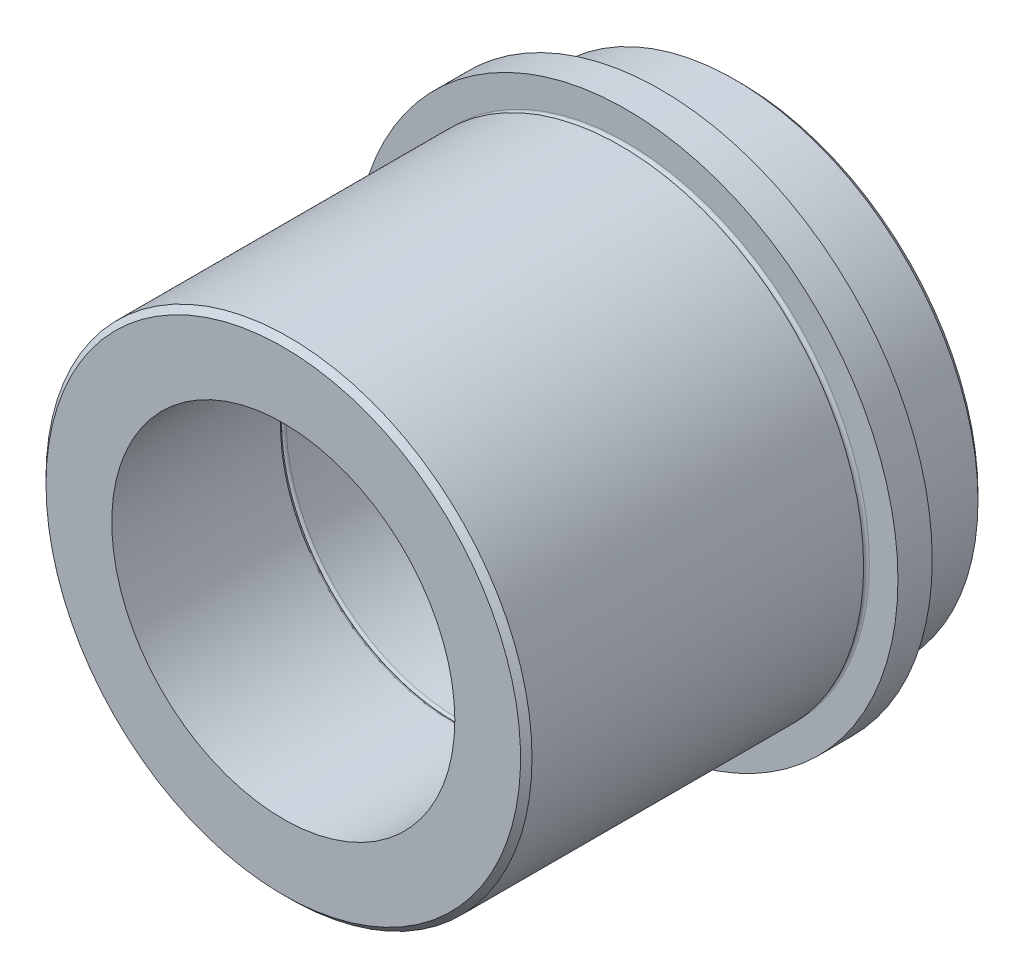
ISO-10303-21;
HEADER;
FILE_DESCRIPTION(('STEP AP214'),'2;1');
FILE_NAME('part.step','',(''),(''),'','','');
FILE_SCHEMA(('AUTOMOTIVE_DESIGN { 1 0 10303 214 1 1 1 1 }'));
ENDSEC;
DATA;
#1=APPLICATION_CONTEXT('core data for automotive mechanical design processes');
#2=APPLICATION_PROTOCOL_DEFINITION('international standard','automotive_design',2000,#1);
#3=PRODUCT_CONTEXT('',#1,'mechanical');
#4=PRODUCT('Part','Part','',(#3));
#5=PRODUCT_RELATED_PRODUCT_CATEGORY('part','',(#4));
#6=PRODUCT_DEFINITION_FORMATION('','',#4);
#7=PRODUCT_DEFINITION_CONTEXT('part definition',#1,'design');
#8=PRODUCT_DEFINITION('design','',#6,#7);
#9=PRODUCT_DEFINITION_SHAPE('','',#8);
#10=(LENGTH_UNIT() NAMED_UNIT(*) SI_UNIT(.MILLI.,.METRE.));
#11=(NAMED_UNIT(*) PLANE_ANGLE_UNIT() SI_UNIT($,.RADIAN.));
#12=(NAMED_UNIT(*) SI_UNIT($,.STERADIAN.) SOLID_ANGLE_UNIT());
#13=UNCERTAINTY_MEASURE_WITH_UNIT(LENGTH_MEASURE(1.E-05),#10,'distance_accuracy_value','');
#14=(GEOMETRIC_REPRESENTATION_CONTEXT(3) GLOBAL_UNCERTAINTY_ASSIGNED_CONTEXT((#13)) GLOBAL_UNIT_ASSIGNED_CONTEXT((#10,
#11,#12)) REPRESENTATION_CONTEXT('',''));
#15=CARTESIAN_POINT('',(0.,0.,0.));
#16=DIRECTION('',(0.,0.,1.));
#17=DIRECTION('',(1.,0.,0.));
#18=AXIS2_PLACEMENT_3D('',#15,#16,#17);
#19=CARTESIAN_POINT('',(0.,0.,0.));
#20=DIRECTION('',(0.,0.,1.));
#21=DIRECTION('',(1.,0.,0.));
#22=AXIS2_PLACEMENT_3D('',#19,#20,#21);
#23=CYLINDRICAL_SURFACE('',#22,30.);
#24=CARTESIAN_POINT('',(0.,0.,-29.5));
#25=DIRECTION('',(0.,0.,1.));
#26=DIRECTION('',(1.,0.,0.));
#27=AXIS2_PLACEMENT_3D('',#24,#25,#26);
#28=CIRCLE('',#27,30.);
#29=CARTESIAN_POINT('',(30.,0.,-29.5));
#30=VERTEX_POINT('',#29);
#31=EDGE_CURVE('E69',#30,#30,#28,.T.);
#32=ORIENTED_EDGE('',*,*,#31,.F.);
#33=EDGE_LOOP('',(#32));
#34=FACE_BOUND('',#33,.T.);
#35=CARTESIAN_POINT('',(0.,0.,0.));
#36=DIRECTION('',(0.,0.,1.));
#37=DIRECTION('',(1.,0.,0.));
#38=AXIS2_PLACEMENT_3D('',#35,#36,#37);
#39=CIRCLE('',#38,30.);
#40=CARTESIAN_POINT('',(30.,0.,0.));
#41=VERTEX_POINT('',#40);
#42=EDGE_CURVE('E33',#41,#41,#39,.T.);
#43=ORIENTED_EDGE('',*,*,#42,.T.);
#44=EDGE_LOOP('',(#43));
#45=FACE_BOUND('',#44,.T.);
#46=ADVANCED_FACE('F13',(#34,#45),#23,.F.);
#47=CARTESIAN_POINT('',(0.,30.,0.));
#48=DIRECTION('',(0.,0.,-1.));
#49=DIRECTION('',(-1.,0.,0.));
#50=AXIS2_PLACEMENT_3D('',#47,#48,#49);
#51=PLANE('',#50);
#52=CARTESIAN_POINT('',(0.,0.,0.));
#53=DIRECTION('',(0.,0.,-1.));
#54=DIRECTION('',(-1.,0.,0.));
#55=AXIS2_PLACEMENT_3D('',#52,#53,#54);
#56=CIRCLE('',#55,41.5);
#57=CARTESIAN_POINT('',(-41.5,0.,0.));
#58=VERTEX_POINT('',#57);
#59=EDGE_CURVE('E20',#58,#58,#56,.F.);
#60=ORIENTED_EDGE('',*,*,#59,.T.);
#61=EDGE_LOOP('',(#60));
#62=FACE_BOUND('',#61,.T.);
#63=ORIENTED_EDGE('',*,*,#42,.F.);
#64=EDGE_LOOP('',(#63));
#65=FACE_BOUND('',#64,.T.);
#66=ADVANCED_FACE('F77',(#62,#65),#51,.F.);
#67=CARTESIAN_POINT('',(0.,0.,0.));
#68=DIRECTION('',(0.,0.,1.));
#69=DIRECTION('',(1.,0.,0.));
#70=AXIS2_PLACEMENT_3D('',#67,#68,#69);
#71=CYLINDRICAL_SURFACE('',#70,42.5);
#72=CARTESIAN_POINT('',(0.,0.,-1.));
#73=DIRECTION('',(0.,0.,-1.));
#74=DIRECTION('',(-1.,0.,0.));
#75=AXIS2_PLACEMENT_3D('',#72,#73,#74);
#76=CIRCLE('',#75,42.5);
#77=CARTESIAN_POINT('',(-42.5,0.,-1.));
#78=VERTEX_POINT('',#77);
#79=EDGE_CURVE('E8',#78,#78,#76,.T.);
#80=ORIENTED_EDGE('',*,*,#79,.T.);
#81=EDGE_LOOP('',(#80));
#82=FACE_BOUND('',#81,.T.);
#83=CARTESIAN_POINT('',(0.,0.,-59.));
#84=DIRECTION('',(0.,0.,1.));
#85=DIRECTION('',(1.,0.,0.));
#86=AXIS2_PLACEMENT_3D('',#83,#84,#85);
#87=CIRCLE('',#86,42.5);
#88=CARTESIAN_POINT('',(42.5,0.,-59.));
#89=VERTEX_POINT('',#88);
#90=EDGE_CURVE('E36',#89,#89,#87,.T.);
#91=ORIENTED_EDGE('',*,*,#90,.T.);
#92=EDGE_LOOP('',(#91));
#93=FACE_BOUND('',#92,.T.);
#94=ADVANCED_FACE('F82',(#82,#93),#71,.T.);
#95=CARTESIAN_POINT('',(0.,0.,-59.5));
#96=DIRECTION('',(0.,0.,1.));
#97=DIRECTION('',(1.,0.,0.));
#98=AXIS2_PLACEMENT_3D('',#95,#96,#97);
#99=TOROIDAL_SURFACE('',#98,42.5,0.5);
#100=ORIENTED_EDGE('',*,*,#90,.F.);
#101=EDGE_LOOP('',(#100));
#102=FACE_BOUND('',#101,.T.);
#103=CARTESIAN_POINT('',(0.,0.,-60.));
#104=DIRECTION('',(0.,0.,1.));
#105=DIRECTION('',(1.,0.,0.));
#106=AXIS2_PLACEMENT_3D('',#103,#104,#105);
#107=CIRCLE('',#106,42.5);
#108=CARTESIAN_POINT('',(42.5,0.,-60.));
#109=VERTEX_POINT('',#108);
#110=EDGE_CURVE('E39',#109,#109,#107,.T.);
#111=ORIENTED_EDGE('',*,*,#110,.T.);
#112=EDGE_LOOP('',(#111));
#113=FACE_BOUND('',#112,.T.);
#114=ADVANCED_FACE('F89',(#102,#113),#99,.F.);
#115=CARTESIAN_POINT('',(0.,42.5,-60.));
#116=DIRECTION('',(0.,0.,-1.));
#117=DIRECTION('',(-1.,0.,0.));
#118=AXIS2_PLACEMENT_3D('',#115,#116,#117);
#119=PLANE('',#118);
#120=ORIENTED_EDGE('',*,*,#110,.F.);
#121=EDGE_LOOP('',(#120));
#122=FACE_BOUND('',#121,.T.);
#123=CARTESIAN_POINT('',(0.,0.,-60.));
#124=DIRECTION('',(0.,0.,1.));
#125=DIRECTION('',(1.,0.,0.));
#126=AXIS2_PLACEMENT_3D('',#123,#124,#125);
#127=CIRCLE('',#126,47.5);
#128=CARTESIAN_POINT('',(47.5,0.,-60.));
#129=VERTEX_POINT('',#128);
#130=EDGE_CURVE('E42',#129,#129,#127,.T.);
#131=ORIENTED_EDGE('',*,*,#130,.T.);
#132=EDGE_LOOP('',(#131));
#133=FACE_BOUND('',#132,.T.);
#134=ADVANCED_FACE('F124',(#122,#133),#119,.F.);
#135=CARTESIAN_POINT('',(0.,0.,0.));
#136=DIRECTION('',(0.,0.,1.));
#137=DIRECTION('',(1.,0.,0.));
#138=AXIS2_PLACEMENT_3D('',#135,#136,#137);
#139=CYLINDRICAL_SURFACE('',#138,47.5);
#140=ORIENTED_EDGE('',*,*,#130,.F.);
#141=EDGE_LOOP('',(#140));
#142=FACE_BOUND('',#141,.T.);
#143=CARTESIAN_POINT('',(0.,0.,-66.));
#144=DIRECTION('',(0.,0.,1.));
#145=DIRECTION('',(1.,0.,0.));
#146=AXIS2_PLACEMENT_3D('',#143,#144,#145);
#147=CIRCLE('',#146,47.5);
#148=CARTESIAN_POINT('',(47.5,0.,-66.));
#149=VERTEX_POINT('',#148);
#150=EDGE_CURVE('E45',#149,#149,#147,.T.);
#151=ORIENTED_EDGE('',*,*,#150,.T.);
#152=EDGE_LOOP('',(#151));
#153=FACE_BOUND('',#152,.T.);
#154=ADVANCED_FACE('F117',(#142,#153),#139,.T.);
#155=CARTESIAN_POINT('',(0.,47.5,-66.));
#156=DIRECTION('',(0.,0.,1.));
#157=DIRECTION('',(1.,0.,0.));
#158=AXIS2_PLACEMENT_3D('',#155,#156,#157);
#159=PLANE('',#158);
#160=ORIENTED_EDGE('',*,*,#150,.F.);
#161=EDGE_LOOP('',(#160));
#162=FACE_BOUND('',#161,.T.);
#163=CARTESIAN_POINT('',(0.,0.,-66.));
#164=DIRECTION('',(0.,0.,1.));
#165=DIRECTION('',(1.,0.,0.));
#166=AXIS2_PLACEMENT_3D('',#163,#164,#165);
#167=CIRCLE('',#166,42.5);
#168=CARTESIAN_POINT('',(42.5,0.,-66.));
#169=VERTEX_POINT('',#168);
#170=EDGE_CURVE('E48',#169,#169,#167,.T.);
#171=ORIENTED_EDGE('',*,*,#170,.T.);
#172=EDGE_LOOP('',(#171));
#173=FACE_BOUND('',#172,.T.);
#174=ADVANCED_FACE('F112',(#162,#173),#159,.F.);
#175=CARTESIAN_POINT('',(0.,0.,0.));
#176=DIRECTION('',(0.,0.,1.));
#177=DIRECTION('',(1.,0.,0.));
#178=AXIS2_PLACEMENT_3D('',#175,#176,#177);
#179=CYLINDRICAL_SURFACE('',#178,42.5);
#180=CARTESIAN_POINT('',(0.,0.,-79.));
#181=DIRECTION('',(0.,0.,1.));
#182=DIRECTION('',(1.,0.,0.));
#183=AXIS2_PLACEMENT_3D('',#180,#181,#182);
#184=CIRCLE('',#183,42.5);
#185=CARTESIAN_POINT('',(42.5,0.,-79.));
#186=VERTEX_POINT('',#185);
#187=EDGE_CURVE('E28',#186,#186,#184,.T.);
#188=ORIENTED_EDGE('',*,*,#187,.T.);
#189=EDGE_LOOP('',(#188));
#190=FACE_BOUND('',#189,.T.);
#191=ORIENTED_EDGE('',*,*,#170,.F.);
#192=EDGE_LOOP('',(#191));
#193=FACE_BOUND('',#192,.T.);
#194=ADVANCED_FACE('F108',(#190,#193),#179,.T.);
#195=CARTESIAN_POINT('',(0.,42.5,-80.));
#196=DIRECTION('',(0.,0.,1.));
#197=DIRECTION('',(1.,0.,0.));
#198=AXIS2_PLACEMENT_3D('',#195,#196,#197);
#199=PLANE('',#198);
#200=CARTESIAN_POINT('',(0.,0.,-80.));
#201=DIRECTION('',(0.,0.,1.));
#202=DIRECTION('',(1.,0.,0.));
#203=AXIS2_PLACEMENT_3D('',#200,#201,#202);
#204=CIRCLE('',#203,41.5);
#205=CARTESIAN_POINT('',(41.5,0.,-80.));
#206=VERTEX_POINT('',#205);
#207=EDGE_CURVE('E24',#206,#206,#204,.F.);
#208=ORIENTED_EDGE('',*,*,#207,.T.);
#209=EDGE_LOOP('',(#208));
#210=FACE_BOUND('',#209,.T.);
#211=CARTESIAN_POINT('',(0.,0.,-80.));
#212=DIRECTION('',(0.,0.,1.));
#213=DIRECTION('',(1.,0.,0.));
#214=AXIS2_PLACEMENT_3D('',#211,#212,#213);
#215=CIRCLE('',#214,30.);
#216=CARTESIAN_POINT('',(30.,0.,-80.));
#217=VERTEX_POINT('',#216);
#218=EDGE_CURVE('E51',#217,#217,#215,.T.);
#219=ORIENTED_EDGE('',*,*,#218,.T.);
#220=EDGE_LOOP('',(#219));
#221=FACE_BOUND('',#220,.T.);
#222=ADVANCED_FACE('F111',(#210,#221),#199,.F.);
#223=CARTESIAN_POINT('',(0.,0.,0.));
#224=DIRECTION('',(0.,0.,1.));
#225=DIRECTION('',(1.,0.,0.));
#226=AXIS2_PLACEMENT_3D('',#223,#224,#225);
#227=CYLINDRICAL_SURFACE('',#226,30.);
#228=ORIENTED_EDGE('',*,*,#218,.F.);
#229=EDGE_LOOP('',(#228));
#230=FACE_BOUND('',#229,.T.);
#231=CARTESIAN_POINT('',(0.,0.,-60.5));
#232=DIRECTION('',(0.,0.,1.));
#233=DIRECTION('',(1.,0.,0.));
#234=AXIS2_PLACEMENT_3D('',#231,#232,#233);
#235=CIRCLE('',#234,30.);
#236=CARTESIAN_POINT('',(30.,0.,-60.5));
#237=VERTEX_POINT('',#236);
#238=EDGE_CURVE('E54',#237,#237,#235,.T.);
#239=ORIENTED_EDGE('',*,*,#238,.T.);
#240=EDGE_LOOP('',(#239));
#241=FACE_BOUND('',#240,.T.);
#242=ADVANCED_FACE('F240',(#230,#241),#227,.F.);
#243=CARTESIAN_POINT('',(0.,0.,-60.5));
#244=DIRECTION('',(0.,0.,1.));
#245=DIRECTION('',(1.,0.,0.));
#246=AXIS2_PLACEMENT_3D('',#243,#244,#245);
#247=TOROIDAL_SURFACE('',#246,30.5,0.5);
#248=ORIENTED_EDGE('',*,*,#238,.F.);
#249=EDGE_LOOP('',(#248));
#250=FACE_BOUND('',#249,.T.);
#251=CARTESIAN_POINT('',(0.,0.,-60.));
#252=DIRECTION('',(0.,0.,1.));
#253=DIRECTION('',(1.,0.,0.));
#254=AXIS2_PLACEMENT_3D('',#251,#252,#253);
#255=CIRCLE('',#254,30.5);
#256=CARTESIAN_POINT('',(30.5,0.,-60.));
#257=VERTEX_POINT('',#256);
#258=EDGE_CURVE('E57',#257,#257,#255,.T.);
#259=ORIENTED_EDGE('',*,*,#258,.T.);
#260=EDGE_LOOP('',(#259));
#261=FACE_BOUND('',#260,.T.);
#262=ADVANCED_FACE('F231',(#250,#261),#247,.T.);
#263=CARTESIAN_POINT('',(0.,0.,-59.5));
#264=DIRECTION('',(0.,0.,1.));
#265=DIRECTION('',(1.,0.,0.));
#266=AXIS2_PLACEMENT_3D('',#263,#264,#265);
#267=TOROIDAL_SURFACE('',#266,30.5,0.5);
#268=ORIENTED_EDGE('',*,*,#258,.F.);
#269=EDGE_LOOP('',(#268));
#270=FACE_BOUND('',#269,.T.);
#271=CARTESIAN_POINT('',(0.,0.,-59.5));
#272=DIRECTION('',(0.,0.,1.));
#273=DIRECTION('',(1.,0.,0.));
#274=AXIS2_PLACEMENT_3D('',#271,#272,#273);
#275=CIRCLE('',#274,30.);
#276=CARTESIAN_POINT('',(30.,0.,-59.5));
#277=VERTEX_POINT('',#276);
#278=EDGE_CURVE('E60',#277,#277,#275,.T.);
#279=ORIENTED_EDGE('',*,*,#278,.T.);
#280=EDGE_LOOP('',(#279));
#281=FACE_BOUND('',#280,.T.);
#282=ADVANCED_FACE('F222',(#270,#281),#267,.T.);
#283=CARTESIAN_POINT('',(0.,0.,0.));
#284=DIRECTION('',(0.,0.,1.));
#285=DIRECTION('',(1.,0.,0.));
#286=AXIS2_PLACEMENT_3D('',#283,#284,#285);
#287=CYLINDRICAL_SURFACE('',#286,30.);
#288=ORIENTED_EDGE('',*,*,#278,.F.);
#289=EDGE_LOOP('',(#288));
#290=FACE_BOUND('',#289,.T.);
#291=CARTESIAN_POINT('',(0.,0.,-30.5));
#292=DIRECTION('',(0.,0.,1.));
#293=DIRECTION('',(1.,0.,0.));
#294=AXIS2_PLACEMENT_3D('',#291,#292,#293);
#295=CIRCLE('',#294,30.);
#296=CARTESIAN_POINT('',(30.,0.,-30.5));
#297=VERTEX_POINT('',#296);
#298=EDGE_CURVE('E63',#297,#297,#295,.T.);
#299=ORIENTED_EDGE('',*,*,#298,.T.);
#300=EDGE_LOOP('',(#299));
#301=FACE_BOUND('',#300,.T.);
#302=ADVANCED_FACE('F214',(#290,#301),#287,.F.);
#303=CARTESIAN_POINT('',(0.,0.,-30.5));
#304=DIRECTION('',(0.,0.,1.));
#305=DIRECTION('',(1.,0.,0.));
#306=AXIS2_PLACEMENT_3D('',#303,#304,#305);
#307=TOROIDAL_SURFACE('',#306,30.5,0.5);
#308=ORIENTED_EDGE('',*,*,#298,.F.);
#309=EDGE_LOOP('',(#308));
#310=FACE_BOUND('',#309,.T.);
#311=CARTESIAN_POINT('',(0.,0.,-30.));
#312=DIRECTION('',(0.,0.,1.));
#313=DIRECTION('',(1.,0.,0.));
#314=AXIS2_PLACEMENT_3D('',#311,#312,#313);
#315=CIRCLE('',#314,30.5);
#316=CARTESIAN_POINT('',(30.5,0.,-30.));
#317=VERTEX_POINT('',#316);
#318=EDGE_CURVE('E66',#317,#317,#315,.T.);
#319=ORIENTED_EDGE('',*,*,#318,.T.);
#320=EDGE_LOOP('',(#319));
#321=FACE_BOUND('',#320,.T.);
#322=ADVANCED_FACE('F101',(#310,#321),#307,.T.);
#323=CARTESIAN_POINT('',(0.,0.,-29.5));
#324=DIRECTION('',(0.,0.,1.));
#325=DIRECTION('',(1.,0.,0.));
#326=AXIS2_PLACEMENT_3D('',#323,#324,#325);
#327=TOROIDAL_SURFACE('',#326,30.5,0.5);
#328=ORIENTED_EDGE('',*,*,#318,.F.);
#329=EDGE_LOOP('',(#328));
#330=FACE_BOUND('',#329,.T.);
#331=ORIENTED_EDGE('',*,*,#31,.T.);
#332=EDGE_LOOP('',(#331));
#333=FACE_BOUND('',#332,.T.);
#334=ADVANCED_FACE('F73',(#330,#333),#327,.T.);
#335=CARTESIAN_POINT('',(0.,0.,-79.));
#336=DIRECTION('',(0.,0.,1.));
#337=DIRECTION('',(1.,0.,0.));
#338=AXIS2_PLACEMENT_3D('',#335,#336,#337);
#339=CONICAL_SURFACE('',#338,42.5,0.785398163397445);
#340=ORIENTED_EDGE('',*,*,#207,.F.);
#341=EDGE_LOOP('',(#340));
#342=FACE_BOUND('',#341,.T.);
#343=ORIENTED_EDGE('',*,*,#187,.F.);
#344=EDGE_LOOP('',(#343));
#345=FACE_BOUND('',#344,.T.);
#346=ADVANCED_FACE('F92',(#342,#345),#339,.T.);
#347=CARTESIAN_POINT('',(0.,0.,0.));
#348=DIRECTION('',(0.,0.,-1.));
#349=DIRECTION('',(-1.,0.,0.));
#350=AXIS2_PLACEMENT_3D('',#347,#348,#349);
#351=CONICAL_SURFACE('',#350,41.5,0.785398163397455);
#352=ORIENTED_EDGE('',*,*,#79,.F.);
#353=EDGE_LOOP('',(#352));
#354=FACE_BOUND('',#353,.T.);
#355=ORIENTED_EDGE('',*,*,#59,.F.);
#356=EDGE_LOOP('',(#355));
#357=FACE_BOUND('',#356,.T.);
#358=ADVANCED_FACE('F15',(#354,#357),#351,.T.);
#359=CLOSED_SHELL('',(#46,#66,#94,#114,#134,#154,#174,#194,#222,#242,#262,#282,#302,#322,#334,
#346,#358));
#360=MANIFOLD_SOLID_BREP('B1',#359);
#361=ADVANCED_BREP_SHAPE_REPRESENTATION('',(#18,#360),#14);
#362=SHAPE_DEFINITION_REPRESENTATION(#9,#361);
ENDSEC;
END-ISO-10303-21;
